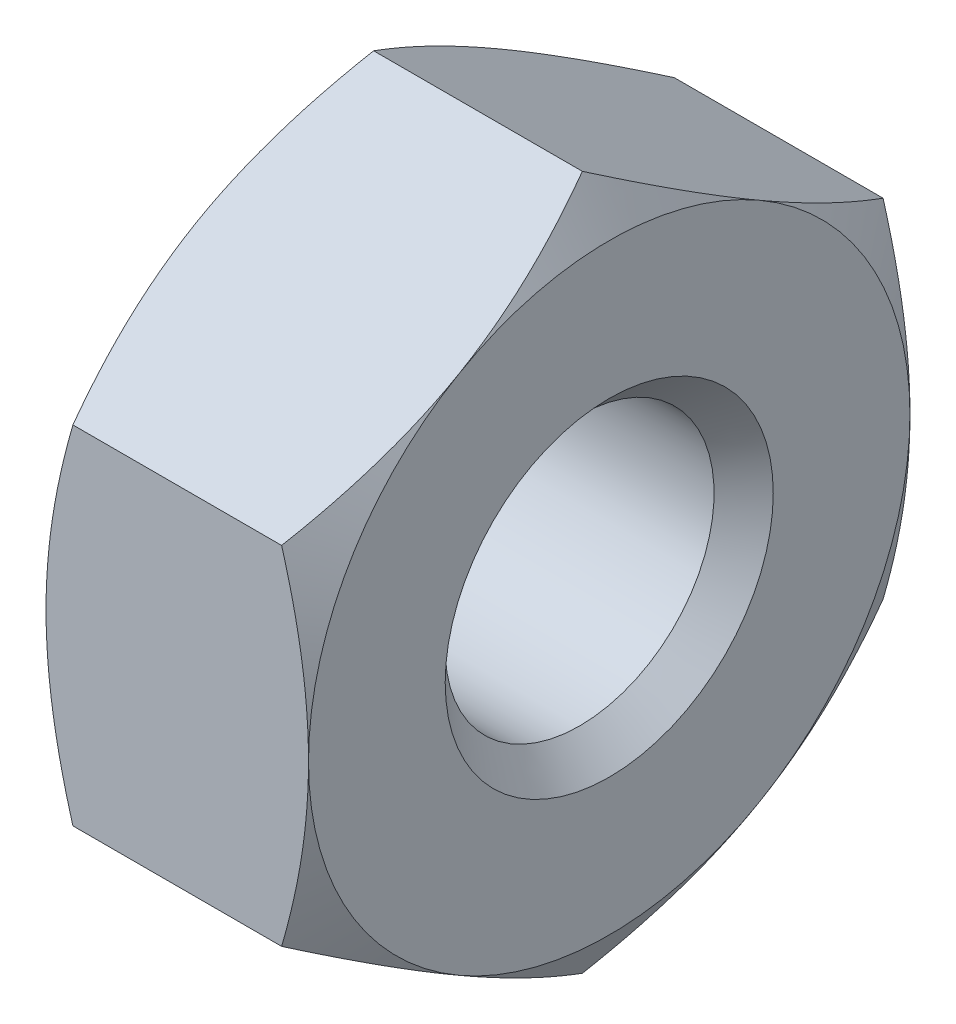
ISO-10303-21;
HEADER;
FILE_DESCRIPTION(('STEP AP214'),'2;1');
FILE_NAME('part.step','',(''),(''),'','','');
FILE_SCHEMA(('AUTOMOTIVE_DESIGN { 1 0 10303 214 1 1 1 1 }'));
ENDSEC;
DATA;
#1=APPLICATION_CONTEXT('core data for automotive mechanical design processes');
#2=APPLICATION_PROTOCOL_DEFINITION('international standard','automotive_design',2000,#1);
#3=PRODUCT_CONTEXT('',#1,'mechanical');
#4=PRODUCT('Part','Part','',(#3));
#5=PRODUCT_RELATED_PRODUCT_CATEGORY('part','',(#4));
#6=PRODUCT_DEFINITION_FORMATION('','',#4);
#7=PRODUCT_DEFINITION_CONTEXT('part definition',#1,'design');
#8=PRODUCT_DEFINITION('design','',#6,#7);
#9=PRODUCT_DEFINITION_SHAPE('','',#8);
#10=(LENGTH_UNIT() NAMED_UNIT(*) SI_UNIT(.MILLI.,.METRE.));
#11=(NAMED_UNIT(*) PLANE_ANGLE_UNIT() SI_UNIT($,.RADIAN.));
#12=(NAMED_UNIT(*) SI_UNIT($,.STERADIAN.) SOLID_ANGLE_UNIT());
#13=UNCERTAINTY_MEASURE_WITH_UNIT(LENGTH_MEASURE(1.E-05),#10,'distance_accuracy_value','');
#14=(GEOMETRIC_REPRESENTATION_CONTEXT(3) GLOBAL_UNCERTAINTY_ASSIGNED_CONTEXT((#13)) GLOBAL_UNIT_ASSIGNED_CONTEXT((#10,
#11,#12)) REPRESENTATION_CONTEXT('',''));
#15=CARTESIAN_POINT('',(0.,0.,0.));
#16=DIRECTION('',(0.,0.,1.));
#17=DIRECTION('',(1.,0.,0.));
#18=AXIS2_PLACEMENT_3D('',#15,#16,#17);
#19=CARTESIAN_POINT('',(3.4,-1.58771324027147,2.75));
#20=DIRECTION('',(0.,0.866025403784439,-0.5));
#21=DIRECTION('',(0.,0.5,0.866025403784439));
#22=AXIS2_PLACEMENT_3D('',#19,#20,#21);
#23=PLANE('',#22);
#24=CARTESIAN_POINT('',(2.1543799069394,-3.17542648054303,-1.6002824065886E-13));
#25=CARTESIAN_POINT('',(2.4,-2.75000000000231,0.73686027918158));
#26=CARTESIAN_POINT('',(2.4,-2.3815698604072,1.375));
#27=B_SPLINE_CURVE_WITH_KNOTS('',2,(#24,#25,#26),.UNSPECIFIED.,.F.,.F.,(3,3),(0.,1.),.UNSPECIFIED.);
#28=CARTESIAN_POINT('',(2.15437990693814,-3.17542648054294,0.));
#29=VERTEX_POINT('',#28);
#30=CARTESIAN_POINT('',(2.4,-2.38156986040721,1.375));
#31=VERTEX_POINT('',#30);
#32=EDGE_CURVE('E440',#29,#31,#27,.T.);
#33=ORIENTED_EDGE('',*,*,#32,.T.);
#34=CARTESIAN_POINT('',(2.4,-2.3815698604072,1.375));
#35=CARTESIAN_POINT('',(2.4,-2.1850538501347,1.71537571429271));
#36=CARTESIAN_POINT('',(2.33369548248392,-1.98006511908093,2.07042661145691));
#37=CARTESIAN_POINT('',(2.27355300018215,-1.79412709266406,2.39248072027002));
#38=CARTESIAN_POINT('',(2.15437990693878,-1.58771324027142,2.75000000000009));
#39=B_SPLINE_CURVE_WITH_KNOTS('',2,(#34,#35,#36,#37,#38),.UNSPECIFIED.,.F.,.F.,(3,2,3),(0.,0.5,
1.),.UNSPECIFIED.);
#40=CARTESIAN_POINT('',(2.15437990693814,-1.58771324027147,2.75));
#41=VERTEX_POINT('',#40);
#42=EDGE_CURVE('E130',#31,#41,#39,.T.);
#43=ORIENTED_EDGE('',*,*,#42,.T.);
#44=DIRECTION('',(-1.,0.,0.));
#45=VECTOR('',#44,1.);
#46=CARTESIAN_POINT('',(3.4,-1.58771324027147,2.75));
#47=LINE('',#46,#45);
#48=CARTESIAN_POINT('',(0.245620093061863,-1.58771324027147,2.75));
#49=VERTEX_POINT('',#48);
#50=EDGE_CURVE('E150',#41,#49,#47,.T.);
#51=ORIENTED_EDGE('',*,*,#50,.T.);
#52=CARTESIAN_POINT('',(0.245620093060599,-1.58771324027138,2.75000000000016));
#53=CARTESIAN_POINT('',(0.,-2.0131397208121,2.01313972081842));
#54=CARTESIAN_POINT('',(0.,-2.3815698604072,1.375));
#55=B_SPLINE_CURVE_WITH_KNOTS('',2,(#52,#53,#54),.UNSPECIFIED.,.F.,.F.,(3,3),(0.,1.),.UNSPECIFIED.);
#56=CARTESIAN_POINT('',(0.,-2.38156986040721,1.375));
#57=VERTEX_POINT('',#56);
#58=EDGE_CURVE('E596',#49,#57,#55,.T.);
#59=ORIENTED_EDGE('',*,*,#58,.T.);
#60=CARTESIAN_POINT('',(0.,-2.3815698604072,1.375));
#61=CARTESIAN_POINT('',(0.,-2.57808587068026,1.03462428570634));
#62=CARTESIAN_POINT('',(0.0663045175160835,-2.78307460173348,0.679573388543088));
#63=CARTESIAN_POINT('',(0.126446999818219,-2.96901262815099,0.35751927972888));
#64=CARTESIAN_POINT('',(0.245620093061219,-3.175426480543,0.));
#65=B_SPLINE_CURVE_WITH_KNOTS('',2,(#60,#61,#62,#63,#64),.UNSPECIFIED.,.F.,.F.,(3,2,3),(0.,0.5,
1.),.UNSPECIFIED.);
#66=CARTESIAN_POINT('',(0.245620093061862,-3.17542648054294,0.));
#67=VERTEX_POINT('',#66);
#68=EDGE_CURVE('E608',#57,#67,#65,.T.);
#69=ORIENTED_EDGE('',*,*,#68,.T.);
#70=DIRECTION('',(-1.,0.,0.));
#71=VECTOR('',#70,1.);
#72=CARTESIAN_POINT('',(3.4,-3.17542648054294,0.));
#73=LINE('',#72,#71);
#74=EDGE_CURVE('E100',#29,#67,#73,.T.);
#75=ORIENTED_EDGE('',*,*,#74,.F.);
#76=EDGE_LOOP('',(#33,#43,#51,#59,#69,#75));
#77=FACE_BOUND('',#76,.T.);
#78=ADVANCED_FACE('F16',(#77),#23,.F.);
#79=CARTESIAN_POINT('',(3.4,3.17542648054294,0.));
#80=DIRECTION('',(0.,-0.866025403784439,-0.5));
#81=DIRECTION('',(0.,0.5,-0.866025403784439));
#82=AXIS2_PLACEMENT_3D('',#79,#80,#81);
#83=PLANE('',#82);
#84=CARTESIAN_POINT('',(2.1543799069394,1.58771324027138,2.75000000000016));
#85=CARTESIAN_POINT('',(2.4,2.01313972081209,2.01313972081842));
#86=CARTESIAN_POINT('',(2.4,2.3815698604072,1.375));
#87=B_SPLINE_CURVE_WITH_KNOTS('',2,(#84,#85,#86),.UNSPECIFIED.,.F.,.F.,(3,3),(0.,1.),.UNSPECIFIED.);
#88=CARTESIAN_POINT('',(2.15437990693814,1.58771324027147,2.75));
#89=VERTEX_POINT('',#88);
#90=CARTESIAN_POINT('',(2.4,2.38156986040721,1.375));
#91=VERTEX_POINT('',#90);
#92=EDGE_CURVE('E124',#89,#91,#87,.T.);
#93=ORIENTED_EDGE('',*,*,#92,.T.);
#94=CARTESIAN_POINT('',(2.4,2.3815698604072,1.375));
#95=CARTESIAN_POINT('',(2.4,2.57808587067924,1.0346242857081));
#96=CARTESIAN_POINT('',(2.33369548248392,2.78307460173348,0.679573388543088));
#97=CARTESIAN_POINT('',(2.27355300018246,2.96901262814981,0.357519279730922));
#98=CARTESIAN_POINT('',(2.15437990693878,3.17542648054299,0.));
#99=B_SPLINE_CURVE_WITH_KNOTS('',2,(#94,#95,#96,#97,#98),.UNSPECIFIED.,.F.,.F.,(3,2,3),(0.,0.5,
1.),.UNSPECIFIED.);
#100=CARTESIAN_POINT('',(2.15437990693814,3.17542648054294,0.));
#101=VERTEX_POINT('',#100);
#102=EDGE_CURVE('E10',#91,#101,#99,.T.);
#103=ORIENTED_EDGE('',*,*,#102,.T.);
#104=DIRECTION('',(-1.,0.,0.));
#105=VECTOR('',#104,1.);
#106=CARTESIAN_POINT('',(3.4,3.17542648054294,0.));
#107=LINE('',#106,#105);
#108=CARTESIAN_POINT('',(0.245620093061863,3.17542648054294,0.));
#109=VERTEX_POINT('',#108);
#110=EDGE_CURVE('E709',#101,#109,#107,.T.);
#111=ORIENTED_EDGE('',*,*,#110,.T.);
#112=CARTESIAN_POINT('',(0.245620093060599,3.17542648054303,-1.57089584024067E-13));
#113=CARTESIAN_POINT('',(0.,2.75000000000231,0.73686027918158));
#114=CARTESIAN_POINT('',(0.,2.3815698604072,1.375));
#115=B_SPLINE_CURVE_WITH_KNOTS('',2,(#112,#113,#114),.UNSPECIFIED.,.F.,.F.,(3,3),(0.,1.),.UNSPECIFIED.);
#116=CARTESIAN_POINT('',(0.,2.38156986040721,1.375));
#117=VERTEX_POINT('',#116);
#118=EDGE_CURVE('E521',#109,#117,#115,.T.);
#119=ORIENTED_EDGE('',*,*,#118,.T.);
#120=CARTESIAN_POINT('',(0.,2.3815698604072,1.375));
#121=CARTESIAN_POINT('',(0.,2.18505385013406,1.71537571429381));
#122=CARTESIAN_POINT('',(0.0663045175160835,1.98006511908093,2.07042661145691));
#123=CARTESIAN_POINT('',(0.126446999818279,1.79412709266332,2.39248072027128));
#124=CARTESIAN_POINT('',(0.245620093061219,1.58771324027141,2.7500000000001));
#125=B_SPLINE_CURVE_WITH_KNOTS('',2,(#120,#121,#122,#123,#124),.UNSPECIFIED.,.F.,.F.,(3,2,3),
(0.,0.5,1.),.UNSPECIFIED.);
#126=CARTESIAN_POINT('',(0.245620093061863,1.58771324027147,2.75));
#127=VERTEX_POINT('',#126);
#128=EDGE_CURVE('E208',#117,#127,#125,.T.);
#129=ORIENTED_EDGE('',*,*,#128,.T.);
#130=DIRECTION('',(-1.,0.,0.));
#131=VECTOR('',#130,1.);
#132=CARTESIAN_POINT('',(3.4,1.58771324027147,2.75));
#133=LINE('',#132,#131);
#134=EDGE_CURVE('E142',#89,#127,#133,.T.);
#135=ORIENTED_EDGE('',*,*,#134,.F.);
#136=EDGE_LOOP('',(#93,#103,#111,#119,#129,#135));
#137=FACE_BOUND('',#136,.T.);
#138=ADVANCED_FACE('F415',(#137),#83,.F.);
#139=CARTESIAN_POINT('',(2.4,0.,0.));
#140=DIRECTION('',(-1.,0.,0.));
#141=DIRECTION('',(0.,-1.,0.));
#142=AXIS2_PLACEMENT_3D('',#139,#140,#141);
#143=CONICAL_SURFACE('',#142,2.75,1.0471975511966);
#144=CARTESIAN_POINT('',(2.4,2.3815698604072,-1.375));
#145=CARTESIAN_POINT('',(2.4,2.18505385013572,-1.71537571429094));
#146=CARTESIAN_POINT('',(2.33369548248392,1.98006511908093,-2.07042661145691));
#147=CARTESIAN_POINT('',(2.27355300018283,1.79412709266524,-2.39248072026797));
#148=CARTESIAN_POINT('',(2.15437990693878,1.58771324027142,-2.75000000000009));
#149=B_SPLINE_CURVE_WITH_KNOTS('',2,(#144,#145,#146,#147,#148),.UNSPECIFIED.,.F.,.F.,(3,2,3),
(0.,0.5,1.),.UNSPECIFIED.);
#150=CARTESIAN_POINT('',(2.4,2.38156986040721,-1.375));
#151=VERTEX_POINT('',#150);
#152=CARTESIAN_POINT('',(2.15437990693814,1.58771324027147,-2.75));
#153=VERTEX_POINT('',#152);
#154=EDGE_CURVE('E225',#151,#153,#149,.T.);
#155=ORIENTED_EDGE('',*,*,#154,.F.);
#156=CARTESIAN_POINT('',(2.4,0.,0.));
#157=DIRECTION('',(1.,0.,0.));
#158=DIRECTION('',(0.,1.,0.));
#159=AXIS2_PLACEMENT_3D('',#156,#157,#158);
#160=CIRCLE('',#159,2.75);
#161=CARTESIAN_POINT('',(2.4000000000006,0.,-2.75));
#162=VERTEX_POINT('',#161);
#163=EDGE_CURVE('E544',#162,#151,#160,.T.);
#164=ORIENTED_EDGE('',*,*,#163,.F.);
#165=CARTESIAN_POINT('',(2.15437990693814,1.58771324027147,-2.75));
#166=CARTESIAN_POINT('',(2.2729112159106,1.17710874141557,-2.75));
#167=CARTESIAN_POINT('',(2.33320987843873,0.806005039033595,-2.75));
#168=CARTESIAN_POINT('',(2.4,0.394950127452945,-2.75));
#169=CARTESIAN_POINT('',(2.4,1.00180280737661E-13,-2.75));
#170=B_SPLINE_CURVE_WITH_KNOTS('',2,(#165,#166,#167,#168,#169),.UNSPECIFIED.,.F.,.F.,(3,2,3),
(0.,0.5,1.),.UNSPECIFIED.);
#171=EDGE_CURVE('E537',#153,#162,#170,.T.);
#172=ORIENTED_EDGE('',*,*,#171,.F.);
#173=EDGE_LOOP('',(#155,#164,#172));
#174=FACE_BOUND('',#173,.T.);
#175=ADVANCED_FACE('F369',(#174),#143,.T.);
#176=CARTESIAN_POINT('',(2.4,0.,0.));
#177=DIRECTION('',(-1.,0.,0.));
#178=DIRECTION('',(0.,-1.,0.));
#179=AXIS2_PLACEMENT_3D('',#176,#177,#178);
#180=CONICAL_SURFACE('',#179,2.75,1.0471975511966);
#181=CARTESIAN_POINT('',(2.1543799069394,3.17542648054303,1.6002824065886E-13));
#182=CARTESIAN_POINT('',(2.4,2.75000000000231,-0.73686027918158));
#183=CARTESIAN_POINT('',(2.4,2.3815698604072,-1.375));
#184=B_SPLINE_CURVE_WITH_KNOTS('',2,(#181,#182,#183),.UNSPECIFIED.,.F.,.F.,(3,3),(0.,1.),.UNSPECIFIED.);
#185=EDGE_CURVE('E710',#101,#151,#184,.T.);
#186=ORIENTED_EDGE('',*,*,#185,.F.);
#187=ORIENTED_EDGE('',*,*,#102,.F.);
#188=CARTESIAN_POINT('',(2.4,0.,0.));
#189=DIRECTION('',(1.,0.,0.));
#190=DIRECTION('',(0.,1.,0.));
#191=AXIS2_PLACEMENT_3D('',#188,#189,#190);
#192=CIRCLE('',#191,2.75);
#193=EDGE_CURVE('E120',#151,#91,#192,.T.);
#194=ORIENTED_EDGE('',*,*,#193,.F.);
#195=EDGE_LOOP('',(#186,#187,#194));
#196=FACE_BOUND('',#195,.T.);
#197=ADVANCED_FACE('F242',(#196),#180,.T.);
#198=CARTESIAN_POINT('',(2.1295,0.,0.));
#199=DIRECTION('',(1.,0.,0.));
#200=DIRECTION('',(0.,1.,0.));
#201=AXIS2_PLACEMENT_3D('',#198,#199,#200);
#202=CONICAL_SURFACE('',#201,1.2295,0.785398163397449);
#203=CARTESIAN_POINT('',(2.1295,0.,0.));
#204=DIRECTION('',(1.,0.,0.));
#205=DIRECTION('',(0.,1.,0.));
#206=AXIS2_PLACEMENT_3D('',#203,#204,#205);
#207=CIRCLE('',#206,1.2295);
#208=CARTESIAN_POINT('',(2.1295,1.2295,0.));
#209=VERTEX_POINT('',#208);
#210=EDGE_CURVE('E28',#209,#209,#207,.T.);
#211=ORIENTED_EDGE('',*,*,#210,.F.);
#212=EDGE_LOOP('',(#211));
#213=FACE_BOUND('',#212,.T.);
#214=CARTESIAN_POINT('',(2.4,0.,0.));
#215=DIRECTION('',(1.,0.,0.));
#216=DIRECTION('',(0.,1.,0.));
#217=AXIS2_PLACEMENT_3D('',#214,#215,#216);
#218=CIRCLE('',#217,1.5);
#219=CARTESIAN_POINT('',(2.4,1.5,0.));
#220=VERTEX_POINT('',#219);
#221=EDGE_CURVE('E451',#220,#220,#218,.T.);
#222=ORIENTED_EDGE('',*,*,#221,.T.);
#223=EDGE_LOOP('',(#222));
#224=FACE_BOUND('',#223,.T.);
#225=ADVANCED_FACE('F627',(#213,#224),#202,.F.);
#226=CARTESIAN_POINT('',(2.4,0.,0.));
#227=DIRECTION('',(1.,0.,0.));
#228=DIRECTION('',(0.,1.,0.));
#229=AXIS2_PLACEMENT_3D('',#226,#227,#228);
#230=CYLINDRICAL_SURFACE('',#229,1.2295);
#231=CARTESIAN_POINT('',(0.2705,0.,0.));
#232=DIRECTION('',(1.,0.,0.));
#233=DIRECTION('',(0.,1.,0.));
#234=AXIS2_PLACEMENT_3D('',#231,#232,#233);
#235=CIRCLE('',#234,1.2295);
#236=CARTESIAN_POINT('',(0.2705,1.2295,0.));
#237=VERTEX_POINT('',#236);
#238=EDGE_CURVE('E708',#237,#237,#235,.T.);
#239=ORIENTED_EDGE('',*,*,#238,.F.);
#240=EDGE_LOOP('',(#239));
#241=FACE_BOUND('',#240,.T.);
#242=ORIENTED_EDGE('',*,*,#210,.T.);
#243=EDGE_LOOP('',(#242));
#244=FACE_BOUND('',#243,.T.);
#245=ADVANCED_FACE('F580',(#241,#244),#230,.F.);
#246=CARTESIAN_POINT('',(0.,0.,0.));
#247=DIRECTION('',(-1.,0.,0.));
#248=DIRECTION('',(0.,-1.,0.));
#249=AXIS2_PLACEMENT_3D('',#246,#247,#248);
#250=CONICAL_SURFACE('',#249,1.5,0.785398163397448);
#251=CARTESIAN_POINT('',(0.,0.,0.));
#252=DIRECTION('',(1.,0.,0.));
#253=DIRECTION('',(0.,1.,0.));
#254=AXIS2_PLACEMENT_3D('',#251,#252,#253);
#255=CIRCLE('',#254,1.5);
#256=CARTESIAN_POINT('',(0.,1.5,0.));
#257=VERTEX_POINT('',#256);
#258=EDGE_CURVE('E600',#257,#257,#255,.T.);
#259=ORIENTED_EDGE('',*,*,#258,.F.);
#260=EDGE_LOOP('',(#259));
#261=FACE_BOUND('',#260,.T.);
#262=ORIENTED_EDGE('',*,*,#238,.T.);
#263=EDGE_LOOP('',(#262));
#264=FACE_BOUND('',#263,.T.);
#265=ADVANCED_FACE('F168',(#261,#264),#250,.F.);
#266=CARTESIAN_POINT('',(0.,2.75,0.));
#267=DIRECTION('',(-1.,0.,0.));
#268=DIRECTION('',(0.,-1.,0.));
#269=AXIS2_PLACEMENT_3D('',#266,#267,#268);
#270=PLANE('',#269);
#271=CARTESIAN_POINT('',(0.,0.,0.));
#272=DIRECTION('',(1.,0.,0.));
#273=DIRECTION('',(0.,1.,0.));
#274=AXIS2_PLACEMENT_3D('',#271,#272,#273);
#275=CIRCLE('',#274,2.75);
#276=CARTESIAN_POINT('',(0.,2.38156986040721,-1.375));
#277=VERTEX_POINT('',#276);
#278=EDGE_CURVE('E518',#277,#117,#275,.T.);
#279=ORIENTED_EDGE('',*,*,#278,.F.);
#280=CARTESIAN_POINT('',(0.,0.,0.));
#281=DIRECTION('',(1.,0.,0.));
#282=DIRECTION('',(0.,1.,0.));
#283=AXIS2_PLACEMENT_3D('',#280,#281,#282);
#284=CIRCLE('',#283,2.75);
#285=CARTESIAN_POINT('',(-5.97776279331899E-13,0.,-2.75));
#286=VERTEX_POINT('',#285);
#287=EDGE_CURVE('E524',#286,#277,#284,.T.);
#288=ORIENTED_EDGE('',*,*,#287,.F.);
#289=CARTESIAN_POINT('',(0.,0.,0.));
#290=DIRECTION('',(1.,0.,0.));
#291=DIRECTION('',(0.,1.,0.));
#292=AXIS2_PLACEMENT_3D('',#289,#290,#291);
#293=CIRCLE('',#292,2.75);
#294=CARTESIAN_POINT('',(0.,-2.38156986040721,-1.375));
#295=VERTEX_POINT('',#294);
#296=EDGE_CURVE('E516',#295,#286,#293,.T.);
#297=ORIENTED_EDGE('',*,*,#296,.F.);
#298=CARTESIAN_POINT('',(0.,0.,0.));
#299=DIRECTION('',(1.,0.,0.));
#300=DIRECTION('',(0.,1.,0.));
#301=AXIS2_PLACEMENT_3D('',#298,#299,#300);
#302=CIRCLE('',#301,2.75);
#303=EDGE_CURVE('E607',#57,#295,#302,.T.);
#304=ORIENTED_EDGE('',*,*,#303,.F.);
#305=CARTESIAN_POINT('',(0.,0.,0.));
#306=DIRECTION('',(1.,0.,0.));
#307=DIRECTION('',(0.,1.,0.));
#308=AXIS2_PLACEMENT_3D('',#305,#306,#307);
#309=CIRCLE('',#308,2.75);
#310=CARTESIAN_POINT('',(-5.97776279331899E-13,0.,2.75));
#311=VERTEX_POINT('',#310);
#312=EDGE_CURVE('E594',#311,#57,#309,.T.);
#313=ORIENTED_EDGE('',*,*,#312,.F.);
#314=CARTESIAN_POINT('',(0.,0.,0.));
#315=DIRECTION('',(1.,0.,0.));
#316=DIRECTION('',(0.,1.,0.));
#317=AXIS2_PLACEMENT_3D('',#314,#315,#316);
#318=CIRCLE('',#317,2.75);
#319=EDGE_CURVE('E211',#117,#311,#318,.T.);
#320=ORIENTED_EDGE('',*,*,#319,.F.);
#321=EDGE_LOOP('',(#279,#288,#297,#304,#313,#320));
#322=FACE_BOUND('',#321,.T.);
#323=ORIENTED_EDGE('',*,*,#258,.T.);
#324=EDGE_LOOP('',(#323));
#325=FACE_BOUND('',#324,.T.);
#326=ADVANCED_FACE('F327',(#322,#325),#270,.T.);
#327=CARTESIAN_POINT('',(1.2,0.,0.));
#328=DIRECTION('',(1.,0.,0.));
#329=DIRECTION('',(0.,1.,0.));
#330=AXIS2_PLACEMENT_3D('',#327,#328,#329);
#331=CONICAL_SURFACE('',#330,4.82846096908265,1.0471975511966);
#332=CARTESIAN_POINT('',(0.,0.,2.75));
#333=CARTESIAN_POINT('',(0.,-0.391670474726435,2.75));
#334=CARTESIAN_POINT('',(0.0658353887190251,-0.80010574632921,2.75));
#335=CARTESIAN_POINT('',(0.12599157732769,-1.1733079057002,2.75));
#336=CARTESIAN_POINT('',(0.24562009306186,-1.58771324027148,2.75));
#337=B_SPLINE_CURVE_WITH_KNOTS('',2,(#332,#333,#334,#335,#336),.UNSPECIFIED.,.F.,.F.,(3,2,3),
(0.,0.5,1.),.UNSPECIFIED.);
#338=EDGE_CURVE('E213',#311,#49,#337,.T.);
#339=ORIENTED_EDGE('',*,*,#338,.F.);
#340=ORIENTED_EDGE('',*,*,#312,.T.);
#341=ORIENTED_EDGE('',*,*,#58,.F.);
#342=EDGE_LOOP('',(#339,#340,#341));
#343=FACE_BOUND('',#342,.T.);
#344=ADVANCED_FACE('F579',(#343),#331,.T.);
#345=CARTESIAN_POINT('',(1.2,0.,0.));
#346=DIRECTION('',(1.,0.,0.));
#347=DIRECTION('',(0.,1.,0.));
#348=AXIS2_PLACEMENT_3D('',#345,#346,#347);
#349=CONICAL_SURFACE('',#348,4.82846096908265,1.0471975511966);
#350=CARTESIAN_POINT('',(0.24562009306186,-1.58771324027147,-2.75));
#351=CARTESIAN_POINT('',(0.12616286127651,-1.17390125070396,-2.75));
#352=CARTESIAN_POINT('',(0.0658353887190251,-0.800105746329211,-2.75));
#353=CARTESIAN_POINT('',(0.,-0.392182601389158,-2.75));
#354=CARTESIAN_POINT('',(0.,1.00180280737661E-13,-2.75));
#355=B_SPLINE_CURVE_WITH_KNOTS('',2,(#350,#351,#352,#353,#354),.UNSPECIFIED.,.F.,.F.,(3,2,3),
(0.,0.5,1.),.UNSPECIFIED.);
#356=CARTESIAN_POINT('',(0.245620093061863,-1.58771324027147,-2.75));
#357=VERTEX_POINT('',#356);
#358=EDGE_CURVE('E542',#357,#286,#355,.T.);
#359=ORIENTED_EDGE('',*,*,#358,.F.);
#360=CARTESIAN_POINT('',(0.,-2.3815698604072,-1.375));
#361=CARTESIAN_POINT('',(0.,-2.18505385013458,-1.71537571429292));
#362=CARTESIAN_POINT('',(0.0663045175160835,-1.98006511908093,-2.07042661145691));
#363=CARTESIAN_POINT('',(0.126446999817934,-1.79412709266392,-2.39248072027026));
#364=CARTESIAN_POINT('',(0.245620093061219,-1.58771324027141,-2.7500000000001));
#365=B_SPLINE_CURVE_WITH_KNOTS('',2,(#360,#361,#362,#363,#364),.UNSPECIFIED.,.F.,.F.,(3,2,3),
(0.,0.5,1.),.UNSPECIFIED.);
#366=EDGE_CURVE('E450',#295,#357,#365,.T.);
#367=ORIENTED_EDGE('',*,*,#366,.F.);
#368=ORIENTED_EDGE('',*,*,#296,.T.);
#369=EDGE_LOOP('',(#359,#367,#368));
#370=FACE_BOUND('',#369,.T.);
#371=ADVANCED_FACE('F570',(#370),#349,.T.);
#372=CARTESIAN_POINT('',(1.2,0.,0.));
#373=DIRECTION('',(1.,0.,0.));
#374=DIRECTION('',(0.,1.,0.));
#375=AXIS2_PLACEMENT_3D('',#372,#373,#374);
#376=CONICAL_SURFACE('',#375,4.82846096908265,1.0471975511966);
#377=ORIENTED_EDGE('',*,*,#128,.F.);
#378=ORIENTED_EDGE('',*,*,#319,.T.);
#379=CARTESIAN_POINT('',(0.245620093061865,1.58771324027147,2.75));
#380=CARTESIAN_POINT('',(0.12708878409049,1.17710874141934,2.75));
#381=CARTESIAN_POINT('',(0.0667901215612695,0.806005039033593,2.75));
#382=CARTESIAN_POINT('',(0.,0.394950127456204,2.75));
#383=CARTESIAN_POINT('',(0.,0.,2.75));
#384=B_SPLINE_CURVE_WITH_KNOTS('',2,(#379,#380,#381,#382,#383),.UNSPECIFIED.,.F.,.F.,(3,2,3),
(0.,0.5,1.),.UNSPECIFIED.);
#385=EDGE_CURVE('E206',#127,#311,#384,.T.);
#386=ORIENTED_EDGE('',*,*,#385,.F.);
#387=EDGE_LOOP('',(#377,#378,#386));
#388=FACE_BOUND('',#387,.T.);
#389=ADVANCED_FACE('F170',(#388),#376,.T.);
#390=CARTESIAN_POINT('',(3.4,1.58771324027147,-2.75));
#391=DIRECTION('',(0.,-0.866025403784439,0.5));
#392=DIRECTION('',(0.,-0.5,-0.866025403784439));
#393=AXIS2_PLACEMENT_3D('',#390,#391,#392);
#394=PLANE('',#393);
#395=ORIENTED_EDGE('',*,*,#185,.T.);
#396=ORIENTED_EDGE('',*,*,#154,.T.);
#397=DIRECTION('',(-1.,0.,0.));
#398=VECTOR('',#397,1.);
#399=CARTESIAN_POINT('',(3.4,1.58771324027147,-2.75));
#400=LINE('',#399,#398);
#401=CARTESIAN_POINT('',(0.245620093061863,1.58771324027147,-2.75));
#402=VERTEX_POINT('',#401);
#403=EDGE_CURVE('E540',#153,#402,#400,.T.);
#404=ORIENTED_EDGE('',*,*,#403,.T.);
#405=CARTESIAN_POINT('',(0.245620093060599,1.58771324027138,-2.75000000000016));
#406=CARTESIAN_POINT('',(0.,2.0131397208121,-2.01313972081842));
#407=CARTESIAN_POINT('',(0.,2.3815698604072,-1.375));
#408=B_SPLINE_CURVE_WITH_KNOTS('',2,(#405,#406,#407),.UNSPECIFIED.,.F.,.F.,(3,3),(0.,1.),.UNSPECIFIED.);
#409=EDGE_CURVE('E529',#402,#277,#408,.T.);
#410=ORIENTED_EDGE('',*,*,#409,.T.);
#411=CARTESIAN_POINT('',(0.,2.3815698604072,-1.375));
#412=CARTESIAN_POINT('',(0.,2.57808587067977,-1.03462428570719));
#413=CARTESIAN_POINT('',(0.0663045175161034,2.78307460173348,-0.679573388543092));
#414=CARTESIAN_POINT('',(0.126446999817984,2.96901262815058,-0.357519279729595));
#415=CARTESIAN_POINT('',(0.245620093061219,3.17542648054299,0.));
#416=B_SPLINE_CURVE_WITH_KNOTS('',2,(#411,#412,#413,#414,#415),.UNSPECIFIED.,.F.,.F.,(3,2,3),
(0.,0.5,1.),.UNSPECIFIED.);
#417=EDGE_CURVE('E272',#277,#109,#416,.T.);
#418=ORIENTED_EDGE('',*,*,#417,.T.);
#419=ORIENTED_EDGE('',*,*,#110,.F.);
#420=EDGE_LOOP('',(#395,#396,#404,#410,#418,#419));
#421=FACE_BOUND('',#420,.T.);
#422=ADVANCED_FACE('F232',(#421),#394,.F.);
#423=CARTESIAN_POINT('',(3.4,-1.58771324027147,-2.75));
#424=DIRECTION('',(0.,0.,1.));
#425=DIRECTION('',(1.,0.,0.));
#426=AXIS2_PLACEMENT_3D('',#423,#424,#425);
#427=PLANE('',#426);
#428=ORIENTED_EDGE('',*,*,#171,.T.);
#429=CARTESIAN_POINT('',(2.4,1.00180280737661E-13,-2.75));
#430=CARTESIAN_POINT('',(2.4,-0.39167047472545,-2.75));
#431=CARTESIAN_POINT('',(2.33416461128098,-0.80010574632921,-2.75));
#432=CARTESIAN_POINT('',(2.27400842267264,-1.17330790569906,-2.75));
#433=CARTESIAN_POINT('',(2.15437990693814,-1.58771324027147,-2.75));
#434=B_SPLINE_CURVE_WITH_KNOTS('',2,(#429,#430,#431,#432,#433),.UNSPECIFIED.,.F.,.F.,(3,2,3),
(0.,0.5,1.),.UNSPECIFIED.);
#435=CARTESIAN_POINT('',(2.15437990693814,-1.58771324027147,-2.75));
#436=VERTEX_POINT('',#435);
#437=EDGE_CURVE('E358',#162,#436,#434,.T.);
#438=ORIENTED_EDGE('',*,*,#437,.T.);
#439=DIRECTION('',(-1.,0.,0.));
#440=VECTOR('',#439,1.);
#441=CARTESIAN_POINT('',(3.4,-1.58771324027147,-2.75));
#442=LINE('',#441,#440);
#443=EDGE_CURVE('E543',#436,#357,#442,.T.);
#444=ORIENTED_EDGE('',*,*,#443,.T.);
#445=ORIENTED_EDGE('',*,*,#358,.T.);
#446=CARTESIAN_POINT('',(0.,1.00180280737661E-13,-2.75));
#447=CARTESIAN_POINT('',(0.,0.394438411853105,-2.75));
#448=CARTESIAN_POINT('',(0.0667901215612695,0.806005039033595,-2.75));
#449=CARTESIAN_POINT('',(0.12691755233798,1.1765155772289,-2.75));
#450=CARTESIAN_POINT('',(0.245620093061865,1.58771324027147,-2.75));
#451=B_SPLINE_CURVE_WITH_KNOTS('',2,(#446,#447,#448,#449,#450),.UNSPECIFIED.,.F.,.F.,(3,2,3),
(0.,0.5,1.),.UNSPECIFIED.);
#452=EDGE_CURVE('E310',#286,#402,#451,.T.);
#453=ORIENTED_EDGE('',*,*,#452,.T.);
#454=ORIENTED_EDGE('',*,*,#403,.F.);
#455=EDGE_LOOP('',(#428,#438,#444,#445,#453,#454));
#456=FACE_BOUND('',#455,.T.);
#457=ADVANCED_FACE('F241',(#456),#427,.F.);
#458=CARTESIAN_POINT('',(3.4,-3.17542648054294,0.));
#459=DIRECTION('',(0.,0.866025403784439,0.5));
#460=DIRECTION('',(0.,-0.5,0.866025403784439));
#461=AXIS2_PLACEMENT_3D('',#458,#459,#460);
#462=PLANE('',#461);
#463=CARTESIAN_POINT('',(2.1543799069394,-1.58771324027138,-2.75000000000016));
#464=CARTESIAN_POINT('',(2.4,-2.01313972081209,-2.01313972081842));
#465=CARTESIAN_POINT('',(2.4,-2.3815698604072,-1.375));
#466=B_SPLINE_CURVE_WITH_KNOTS('',2,(#463,#464,#465),.UNSPECIFIED.,.F.,.F.,(3,3),(0.,1.),.UNSPECIFIED.);
#467=CARTESIAN_POINT('',(2.4,-2.38156986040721,-1.375));
#468=VERTEX_POINT('',#467);
#469=EDGE_CURVE('E383',#436,#468,#466,.T.);
#470=ORIENTED_EDGE('',*,*,#469,.T.);
#471=CARTESIAN_POINT('',(2.4,-2.3815698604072,-1.375));
#472=CARTESIAN_POINT('',(2.4,-2.57808587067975,-1.03462428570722));
#473=CARTESIAN_POINT('',(2.33369548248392,-2.78307460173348,-0.679573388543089));
#474=CARTESIAN_POINT('',(2.27355300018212,-2.9690126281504,-0.357519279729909));
#475=CARTESIAN_POINT('',(2.15437990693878,-3.17542648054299,0.));
#476=B_SPLINE_CURVE_WITH_KNOTS('',2,(#471,#472,#473,#474,#475),.UNSPECIFIED.,.F.,.F.,(3,2,3),
(0.,0.5,1.),.UNSPECIFIED.);
#477=EDGE_CURVE('E456',#468,#29,#476,.T.);
#478=ORIENTED_EDGE('',*,*,#477,.T.);
#479=ORIENTED_EDGE('',*,*,#74,.T.);
#480=CARTESIAN_POINT('',(0.245620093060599,-3.17542648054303,1.56922226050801E-13));
#481=CARTESIAN_POINT('',(0.,-2.75000000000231,-0.736860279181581));
#482=CARTESIAN_POINT('',(0.,-2.3815698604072,-1.375));
#483=B_SPLINE_CURVE_WITH_KNOTS('',2,(#480,#481,#482),.UNSPECIFIED.,.F.,.F.,(3,3),(0.,1.),.UNSPECIFIED.);
#484=EDGE_CURVE('E613',#67,#295,#483,.T.);
#485=ORIENTED_EDGE('',*,*,#484,.T.);
#486=ORIENTED_EDGE('',*,*,#366,.T.);
#487=ORIENTED_EDGE('',*,*,#443,.F.);
#488=EDGE_LOOP('',(#470,#478,#479,#485,#486,#487));
#489=FACE_BOUND('',#488,.T.);
#490=ADVANCED_FACE('F245',(#489),#462,.F.);
#491=CARTESIAN_POINT('',(2.4,1.5,0.));
#492=DIRECTION('',(1.,0.,0.));
#493=DIRECTION('',(0.,1.,0.));
#494=AXIS2_PLACEMENT_3D('',#491,#492,#493);
#495=PLANE('',#494);
#496=ORIENTED_EDGE('',*,*,#221,.F.);
#497=EDGE_LOOP('',(#496));
#498=FACE_BOUND('',#497,.T.);
#499=ORIENTED_EDGE('',*,*,#163,.T.);
#500=ORIENTED_EDGE('',*,*,#193,.T.);
#501=CARTESIAN_POINT('',(2.4,0.,0.));
#502=DIRECTION('',(1.,0.,0.));
#503=DIRECTION('',(0.,1.,0.));
#504=AXIS2_PLACEMENT_3D('',#501,#502,#503);
#505=CIRCLE('',#504,2.75);
#506=CARTESIAN_POINT('',(2.4000000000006,0.,2.75));
#507=VERTEX_POINT('',#506);
#508=EDGE_CURVE('E114',#91,#507,#505,.T.);
#509=ORIENTED_EDGE('',*,*,#508,.T.);
#510=CARTESIAN_POINT('',(2.4,0.,0.));
#511=DIRECTION('',(1.,0.,0.));
#512=DIRECTION('',(0.,1.,0.));
#513=AXIS2_PLACEMENT_3D('',#510,#511,#512);
#514=CIRCLE('',#513,2.75);
#515=EDGE_CURVE('E118',#507,#31,#514,.T.);
#516=ORIENTED_EDGE('',*,*,#515,.T.);
#517=CARTESIAN_POINT('',(2.4,0.,0.));
#518=DIRECTION('',(1.,0.,0.));
#519=DIRECTION('',(0.,1.,0.));
#520=AXIS2_PLACEMENT_3D('',#517,#518,#519);
#521=CIRCLE('',#520,2.75);
#522=EDGE_CURVE('E454',#31,#468,#521,.T.);
#523=ORIENTED_EDGE('',*,*,#522,.T.);
#524=CARTESIAN_POINT('',(2.4,0.,0.));
#525=DIRECTION('',(1.,0.,0.));
#526=DIRECTION('',(0.,1.,0.));
#527=AXIS2_PLACEMENT_3D('',#524,#525,#526);
#528=CIRCLE('',#527,2.75);
#529=EDGE_CURVE('E520',#468,#162,#528,.T.);
#530=ORIENTED_EDGE('',*,*,#529,.T.);
#531=EDGE_LOOP('',(#499,#500,#509,#516,#523,#530));
#532=FACE_BOUND('',#531,.T.);
#533=ADVANCED_FACE('F117',(#498,#532),#495,.T.);
#534=CARTESIAN_POINT('',(2.4,0.,0.));
#535=DIRECTION('',(-1.,0.,0.));
#536=DIRECTION('',(0.,-1.,0.));
#537=AXIS2_PLACEMENT_3D('',#534,#535,#536);
#538=CONICAL_SURFACE('',#537,2.75,1.0471975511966);
#539=ORIENTED_EDGE('',*,*,#477,.F.);
#540=ORIENTED_EDGE('',*,*,#522,.F.);
#541=ORIENTED_EDGE('',*,*,#32,.F.);
#542=EDGE_LOOP('',(#539,#540,#541));
#543=FACE_BOUND('',#542,.T.);
#544=ADVANCED_FACE('F291',(#543),#538,.T.);
#545=CARTESIAN_POINT('',(2.4,0.,0.));
#546=DIRECTION('',(-1.,0.,0.));
#547=DIRECTION('',(0.,-1.,0.));
#548=AXIS2_PLACEMENT_3D('',#545,#546,#547);
#549=CONICAL_SURFACE('',#548,2.75,1.0471975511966);
#550=CARTESIAN_POINT('',(2.4,0.,2.75));
#551=CARTESIAN_POINT('',(2.4,0.39443841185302,2.75));
#552=CARTESIAN_POINT('',(2.33320987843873,0.806005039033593,2.75));
#553=CARTESIAN_POINT('',(2.27308244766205,1.1765155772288,2.75));
#554=CARTESIAN_POINT('',(2.15437990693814,1.58771324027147,2.75));
#555=B_SPLINE_CURVE_WITH_KNOTS('',2,(#550,#551,#552,#553,#554),.UNSPECIFIED.,.F.,.F.,(3,2,3),
(0.,0.5,1.),.UNSPECIFIED.);
#556=EDGE_CURVE('E134',#507,#89,#555,.T.);
#557=ORIENTED_EDGE('',*,*,#556,.F.);
#558=ORIENTED_EDGE('',*,*,#508,.F.);
#559=ORIENTED_EDGE('',*,*,#92,.F.);
#560=EDGE_LOOP('',(#557,#558,#559));
#561=FACE_BOUND('',#560,.T.);
#562=ADVANCED_FACE('F136',(#561),#549,.T.);
#563=CARTESIAN_POINT('',(2.4,0.,0.));
#564=DIRECTION('',(-1.,0.,0.));
#565=DIRECTION('',(0.,-1.,0.));
#566=AXIS2_PLACEMENT_3D('',#563,#564,#565);
#567=CONICAL_SURFACE('',#566,2.75,1.0471975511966);
#568=CARTESIAN_POINT('',(2.15437990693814,-1.58771324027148,2.75));
#569=CARTESIAN_POINT('',(2.27383713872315,-1.17390125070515,2.75));
#570=CARTESIAN_POINT('',(2.33416461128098,-0.80010574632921,2.75));
#571=CARTESIAN_POINT('',(2.4,-0.392182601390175,2.75));
#572=CARTESIAN_POINT('',(2.4,0.,2.75));
#573=B_SPLINE_CURVE_WITH_KNOTS('',2,(#568,#569,#570,#571,#572),.UNSPECIFIED.,.F.,.F.,(3,2,3),
(0.,0.5,1.),.UNSPECIFIED.);
#574=EDGE_CURVE('E129',#41,#507,#573,.T.);
#575=ORIENTED_EDGE('',*,*,#574,.F.);
#576=ORIENTED_EDGE('',*,*,#42,.F.);
#577=ORIENTED_EDGE('',*,*,#515,.F.);
#578=EDGE_LOOP('',(#575,#576,#577));
#579=FACE_BOUND('',#578,.T.);
#580=ADVANCED_FACE('F18',(#579),#567,.T.);
#581=CARTESIAN_POINT('',(2.4,0.,0.));
#582=DIRECTION('',(-1.,0.,0.));
#583=DIRECTION('',(0.,-1.,0.));
#584=AXIS2_PLACEMENT_3D('',#581,#582,#583);
#585=CONICAL_SURFACE('',#584,2.75,1.0471975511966);
#586=ORIENTED_EDGE('',*,*,#437,.F.);
#587=ORIENTED_EDGE('',*,*,#529,.F.);
#588=ORIENTED_EDGE('',*,*,#469,.F.);
#589=EDGE_LOOP('',(#586,#587,#588));
#590=FACE_BOUND('',#589,.T.);
#591=ADVANCED_FACE('F290',(#590),#585,.T.);
#592=CARTESIAN_POINT('',(1.2,0.,0.));
#593=DIRECTION('',(1.,0.,0.));
#594=DIRECTION('',(0.,1.,0.));
#595=AXIS2_PLACEMENT_3D('',#592,#593,#594);
#596=CONICAL_SURFACE('',#595,4.82846096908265,1.0471975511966);
#597=ORIENTED_EDGE('',*,*,#118,.F.);
#598=ORIENTED_EDGE('',*,*,#417,.F.);
#599=ORIENTED_EDGE('',*,*,#278,.T.);
#600=EDGE_LOOP('',(#597,#598,#599));
#601=FACE_BOUND('',#600,.T.);
#602=ADVANCED_FACE('F280',(#601),#596,.T.);
#603=CARTESIAN_POINT('',(1.2,0.,0.));
#604=DIRECTION('',(1.,0.,0.));
#605=DIRECTION('',(0.,1.,0.));
#606=AXIS2_PLACEMENT_3D('',#603,#604,#605);
#607=CONICAL_SURFACE('',#606,4.82846096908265,1.0471975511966);
#608=ORIENTED_EDGE('',*,*,#409,.F.);
#609=ORIENTED_EDGE('',*,*,#452,.F.);
#610=ORIENTED_EDGE('',*,*,#287,.T.);
#611=EDGE_LOOP('',(#608,#609,#610));
#612=FACE_BOUND('',#611,.T.);
#613=ADVANCED_FACE('F289',(#612),#607,.T.);
#614=CARTESIAN_POINT('',(1.2,0.,0.));
#615=DIRECTION('',(1.,0.,0.));
#616=DIRECTION('',(0.,1.,0.));
#617=AXIS2_PLACEMENT_3D('',#614,#615,#616);
#618=CONICAL_SURFACE('',#617,4.82846096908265,1.0471975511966);
#619=ORIENTED_EDGE('',*,*,#484,.F.);
#620=ORIENTED_EDGE('',*,*,#68,.F.);
#621=ORIENTED_EDGE('',*,*,#303,.T.);
#622=EDGE_LOOP('',(#619,#620,#621));
#623=FACE_BOUND('',#622,.T.);
#624=ADVANCED_FACE('F167',(#623),#618,.T.);
#625=CARTESIAN_POINT('',(3.4,1.58771324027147,2.75));
#626=DIRECTION('',(0.,0.,-1.));
#627=DIRECTION('',(-1.,0.,0.));
#628=AXIS2_PLACEMENT_3D('',#625,#626,#627);
#629=PLANE('',#628);
#630=ORIENTED_EDGE('',*,*,#574,.T.);
#631=ORIENTED_EDGE('',*,*,#556,.T.);
#632=ORIENTED_EDGE('',*,*,#134,.T.);
#633=ORIENTED_EDGE('',*,*,#385,.T.);
#634=ORIENTED_EDGE('',*,*,#338,.T.);
#635=ORIENTED_EDGE('',*,*,#50,.F.);
#636=EDGE_LOOP('',(#630,#631,#632,#633,#634,#635));
#637=FACE_BOUND('',#636,.T.);
#638=ADVANCED_FACE('F147',(#637),#629,.F.);
#639=CLOSED_SHELL('',(#78,#138,#175,#197,#225,#245,#265,#326,#344,#371,#389,#422,#457,#490,#533,
#544,#562,#580,#591,#602,#613,#624,#638));
#640=MANIFOLD_SOLID_BREP('B1',#639);
#641=ADVANCED_BREP_SHAPE_REPRESENTATION('',(#18,#640),#14);
#642=SHAPE_DEFINITION_REPRESENTATION(#9,#641);
ENDSEC;
END-ISO-10303-21;
